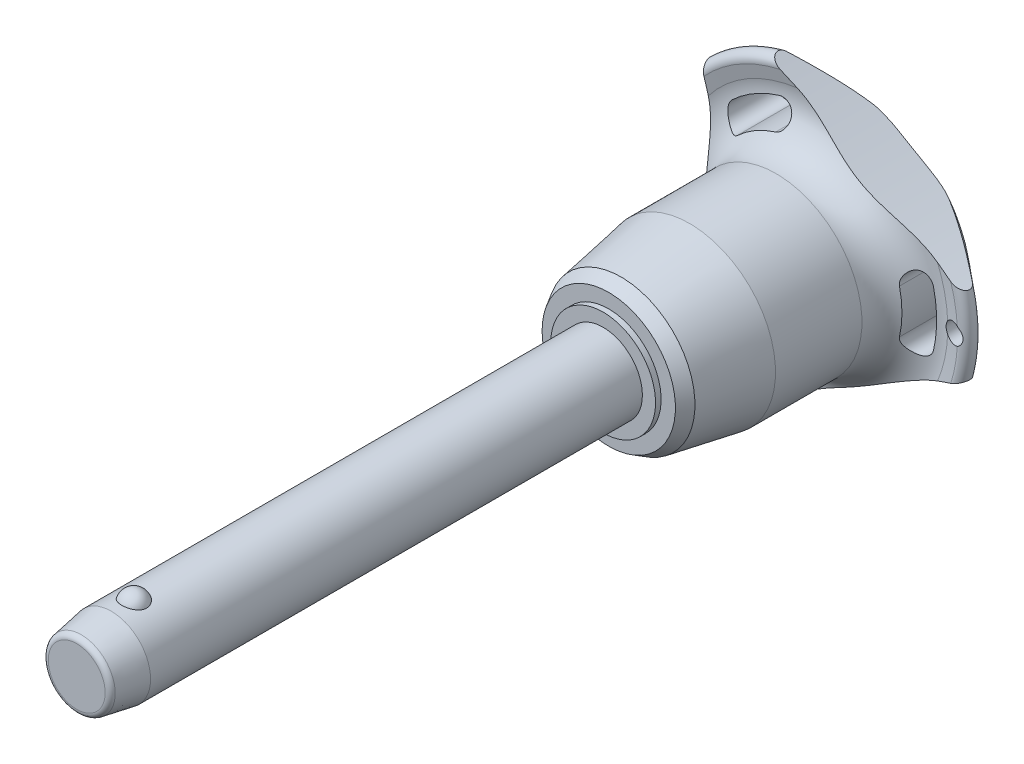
from build123d import *

# Parameters (mm, degrees)
SKETCH1_R           = 6
BOSS_EXTRUDE1_DEPTH = 70
SKETCH2_R           = 5.15
BOSS_EXTRUDE2_DEPTH = 39.7
BOSS_EXTRUDE3_START = 10.6
SKETCH1_2_R         = 6
BOSS_EXTRUDE3_DEPTH = 10.6
CHAMFER1_SIZE       = 5.3
CHAMFER1_SIZE2      = 0.934532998
FILLET1_R           = 0.85
SKETCH6_R           = 144.275
CUT_EXTRUDE1_DEPTH  = 115.750268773
CIRPATTERN1_COUNT   = 3
SKETCH7_R           = 1.5
CUT_EXTRUDE2_DEPTH  = 115.575242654


with BuildPart() as part:
    # Sketch1 → Boss-Extrude1 (new body)
    with BuildSketch(Plane.XY):
        Circle(SKETCH1_R)
    extrude(amount=-BOSS_EXTRUDE1_DEPTH)

    # Sketch2 → Boss-Extrude2 (add)
    with BuildSketch(Plane(origin=(0, 0, -70), x_dir=(-1, 0, 0), z_dir=(0, 0, -1))):
        Circle(SKETCH2_R)
    extrude(amount=BOSS_EXTRUDE2_DEPTH)

    # Sketch3 → Revolve1 (revolve)
    with BuildSketch(Plane(origin=(0, 0, 0), x_dir=(0, 0, -1), z_dir=(1, 0, 0))):
        with BuildLine():
            Line((-1.854049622, 7.25), (-1.854049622, 3.25))
            ThreePointArc((-1.854049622, 3.25), (0.145950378, 5.25), (-1.854049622, 7.25))
        make_face()
        with BuildLine():
            Line((-1.854049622, -3.25), (-1.854049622, -7.25))
            ThreePointArc((-1.854049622, -7.25), (0.145950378, -5.25), (-1.854049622, -3.25))
        make_face()
    revolve(axis=Axis((0, -3.25, 1.854049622), (0, 1, 0)))

    # Sketch1_2 → Boss-Extrude3 (add)
    with BuildSketch(Plane.XY.offset(BOSS_EXTRUDE3_START)):
        Circle(SKETCH1_2_R)
    extrude(amount=-BOSS_EXTRUDE3_DEPTH)

    # Chamfer1
    chamfer1_edges = [part.edges().sort_by_distance(p)[0] for p in [
        (-6, 0, 10.6),
    ]]
    chamfer1_side = [part.faces().sort_by_distance(p)[0] for p in [
        (-6, 0, -29.7),
    ]]
    chamfer(chamfer1_edges, length=CHAMFER1_SIZE, length2=CHAMFER1_SIZE2, reference=chamfer1_side[0])

    # Fillet1
    fillet1_edges = [part.edges().sort_by_distance(p)[0] for p in [
        (-5.065467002, 0, 10.6),
        (5.15, 0, -109.7),
    ]]
    fillet(fillet1_edges, radius=FILLET1_R)

    # Sketch4 → Revolve2 (revolve)
    with BuildSketch(Plane(origin=(0, 0, 0), x_dir=(0, 0, -1), z_dir=(1, 0, 0)), mode=Mode.PRIVATE) as revolve2_sk:
        Polygon((70, 0), (70, 8.017240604), (70.85, 8.017240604), (70.85, 10.206249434), (72.745737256, 11.300753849), (83.233333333, 13.15), (96.466666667, 13.15), (96.466666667, 0), align=None)
    revolve(revolve2_sk.sketch.rotate(Axis((0, 0, -96.466666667), (0, 0, 1)), 90), axis=Axis((0, 0, -96.466666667), (0, 0, 1)))

    # Sketch5 → Revolve3 (revolve)
    with BuildSketch(Plane(origin=(0, 0, 0), x_dir=(0, 0, -1), z_dir=(1, 0, 0)), mode=Mode.PRIVATE) as revolve3_sk:
        with BuildLine():
            Line((102.32877039, 20.428960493), (101.910912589, 22.344207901))
            ThreePointArc((101.910912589, 22.344207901), (102.554394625, 23.677136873), (104.002586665, 23.371345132))
            Line((104.002586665, 23.371345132), (109.141488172, 17.247040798))
            ThreePointArc((109.141488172, 17.247040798), (109.7, 15.584758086), (108.978803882, 13.986322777))
            ThreePointArc((108.978803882, 13.986322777), (104.617427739, 7.589034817), (103.083333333, 0))
            Line((103.083333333, 0), (96.466666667, 0))
            Line((96.466666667, 0), (96.466666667, 13.15))
            ThreePointArc((96.466666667, 13.15), (101.139661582, 15.38660811), (102.32877039, 20.428960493))
        make_face()
    revolve(revolve3_sk.sketch.rotate(Axis((0, 0, -103.083333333), (0, 0, 1)), 90), axis=Axis((0, 0, -103.083333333), (0, 0, 1)))

    # Sketch6 → Cut-Extrude1 (cut, through all)
    with BuildSketch(Plane.XY):
        with Locations((-159.975, 0)):
            Circle(SKETCH6_R)
        with BuildLine():
            ThreePointArc((18.131206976, -4.190753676), (18.60922037, 0), (18.131206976, 4.190753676))
            ThreePointArc((18.131206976, 4.190753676), (15.94840906, 5.553949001), (14.585213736, 3.371151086))
            ThreePointArc((14.585213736, 3.371151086), (14.969740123, 0), (14.585213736, -3.371151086))
            ThreePointArc((14.585213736, -3.371151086), (15.94840906, -5.553949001), (18.131206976, -4.190753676))
        make_face()
    cut_extrude1 = extrude(amount=-CUT_EXTRUDE1_DEPTH, mode=Mode.SUBTRACT)

    # CirPattern1: Cut-Extrude1 ×3 about axis
    cirpattern1_axis = Axis((0, 0, 0), (0, 0, 1))
    for i in range(1, CIRPATTERN1_COUNT):
        add(cut_extrude1.rotate(cirpattern1_axis, i * 360 / CIRPATTERN1_COUNT), mode=Mode.SUBTRACT)

    # Sketch7 → Cut-Extrude2 (cut, through all)
    with BuildSketch(Plane.XY):
        with Locations(Location((21.60922037, 0, 0), (0, 0, 297.620773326))):
            Circle(SKETCH7_R)
    extrude(amount=-CUT_EXTRUDE2_DEPTH, mode=Mode.SUBTRACT)


solid = part.part
